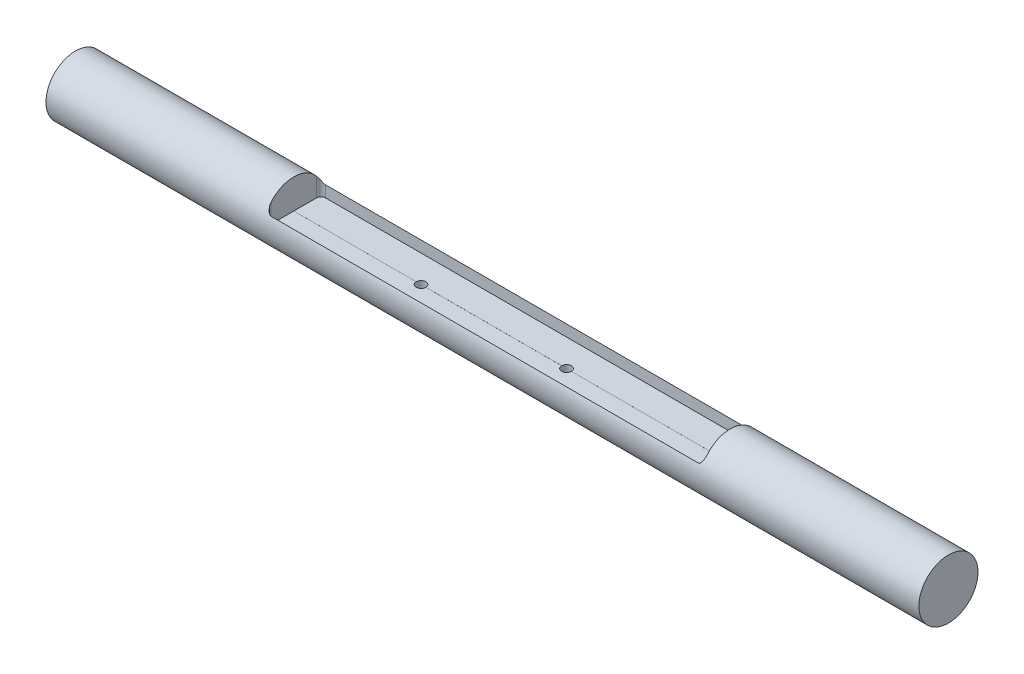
from build123d import *

# Parameters (mm, degrees)
SKETCH1_R         = 20.6375
SKETCH1_R_2       = 0.0127
EXTRUDE1_DEPTH    = 304.8
POCKET_DEPTH      = 307.194142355
SKETCH4_R         = 3.3782
SCREW_HOLES_DEPTH = 307.194142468


with BuildPart() as part:
    # Sketch1 → Extrude1 (new, symmetric)
    with BuildSketch(Plane(origin=(0, 0, 0), x_dir=(0, 0, -1), z_dir=(1, 0, 0))):
        with Locations(Location((0, 0, 0), (0, 0, 180))):
            Circle(SKETCH1_R)
        Circle(SKETCH1_R_2, mode=Mode.SUBTRACT)
    extrude(amount=EXTRUDE1_DEPTH, both=True)

    # Sketch3 → Pocket (cut, through all)
    with BuildSketch(Plane(origin=(0, 0, 0), x_dir=(1, 0, 0), z_dir=(0, 1, 0))):
        with BuildLine():
            Line((149.225, 19.05), (-149.225, 19.05))
            ThreePointArc((-149.225, 19.05), (-151.47006403, 18.12006403), (-152.4, 15.875))
            Line((-152.4, 15.875), (-152.4, -15.875))
            ThreePointArc((-152.4, -15.875), (-151.47006403, -18.12006403), (-149.225, -19.05))
            Line((-149.225, -19.05), (149.225, -19.05))
            ThreePointArc((149.225, -19.05), (151.47006403, -18.12006403), (152.4, -15.875))
            Line((152.4, -15.875), (152.4, 15.875))
            ThreePointArc((152.4, 15.875), (151.47006403, 18.12006403), (149.225, 19.05))
        make_face()
    extrude(amount=POCKET_DEPTH, mode=Mode.SUBTRACT)

    # Sketch4 → Screw holes (cut, through all)
    with BuildSketch(Plane(origin=(0, 0, 0), x_dir=(1, 0, 0), z_dir=(0, 1, 0))):
        with Locations(Location((38.1, 0, 0), (0, 0, 180.215398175))):
            Circle(SKETCH4_R)
        with Locations(Location((-63.5, 0, 0), (0, 0, 180.215398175))):
            Circle(SKETCH4_R)
    extrude(amount=-SCREW_HOLES_DEPTH, mode=Mode.SUBTRACT)


solid = part.part
